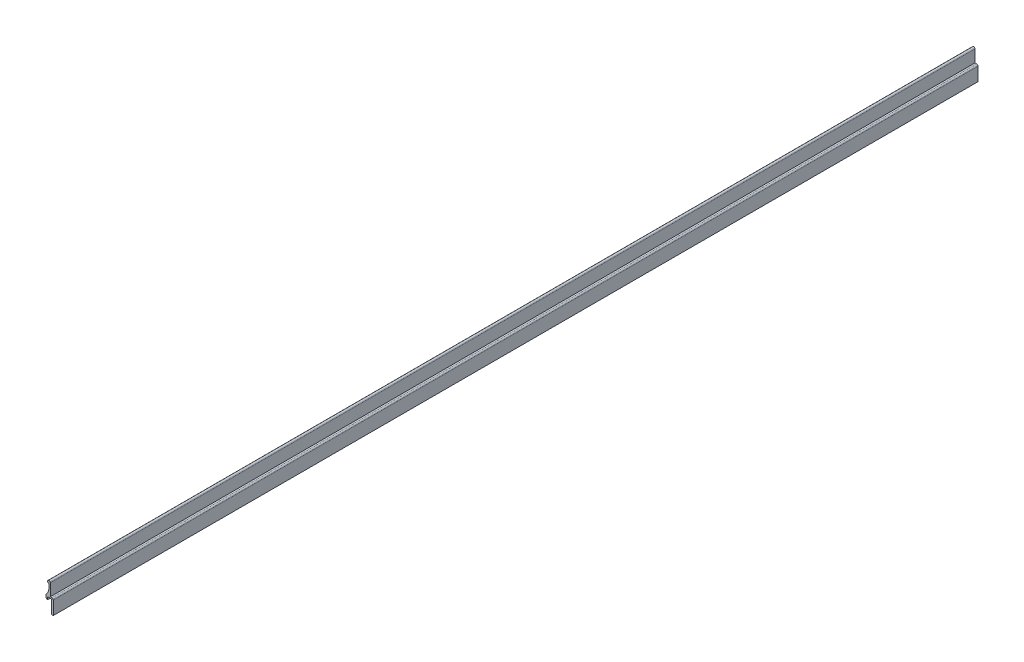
from build123d import *

# Parameters (mm, degrees)
BOSS_EXTRU_1_DEPTH = 687


with BuildPart() as part:
    # Esquisse1 → Boss.-Extru.1 (new body)
    with BuildSketch(Plane(origin=(0, 0, -687), x_dir=(-1, 0, 0), z_dir=(0, 0, -1))):
        with BuildLine():
            Line((-2, 10), (-2, 1))
            Line((-2, 1), (-3.2, 1))
            ThreePointArc((-3.2, 1), (-3.907106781, 0.707106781), (-4.2, 0))
            Line((-4.2, 0), (-4.2, -10))
            Line((-4.2, -10), (-3, -10))
            Line((-3, -10), (-3, -0.5))
            ThreePointArc((-3, -0.5), (-2.853553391, -0.146446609), (-2.5, 0))
            Line((-2.5, 0), (0, 0))
            Line((0, 0), (-0.15, -1.85))
            Line((-0.15, -1.85), (0.968918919, -1.85))
            Line((0.968918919, -1.85), (1.2, 1))
            ThreePointArc((1.2, 1), (-0.429670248, 3.543511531), (-1, 6.509990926))
            Line((-1, 6.509990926), (-1, 9))
            ThreePointArc((-1, 9), (-0.292893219, 10.707106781), (-2, 10))
        make_face()
    extrude(amount=-BOSS_EXTRU_1_DEPTH)


solid = part.part
